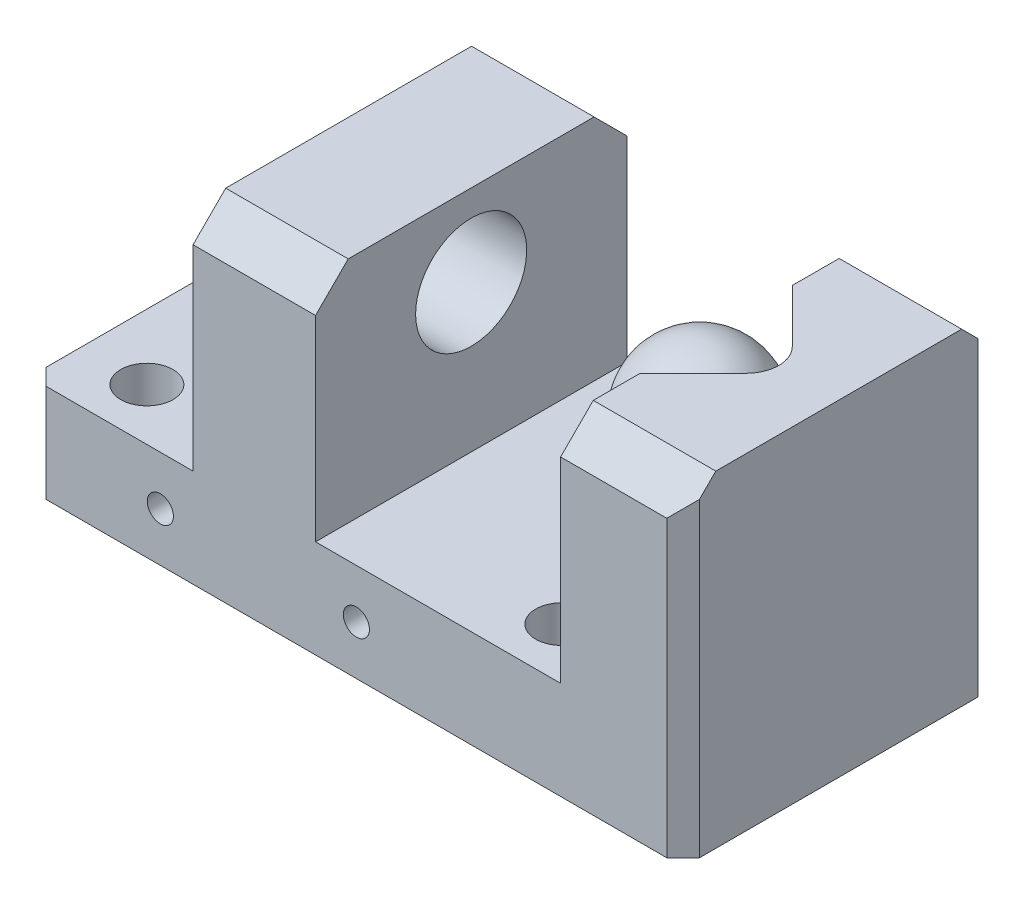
ISO-10303-21;
HEADER;
FILE_DESCRIPTION(('STEP AP214'),'2;1');
FILE_NAME('part.step','',(''),(''),'','','');
FILE_SCHEMA(('AUTOMOTIVE_DESIGN { 1 0 10303 214 1 1 1 1 }'));
ENDSEC;
DATA;
#1=APPLICATION_CONTEXT('core data for automotive mechanical design processes');
#2=APPLICATION_PROTOCOL_DEFINITION('international standard','automotive_design',2000,#1);
#3=PRODUCT_CONTEXT('',#1,'mechanical');
#4=PRODUCT('Part','Part','',(#3));
#5=PRODUCT_RELATED_PRODUCT_CATEGORY('part','',(#4));
#6=PRODUCT_DEFINITION_FORMATION('','',#4);
#7=PRODUCT_DEFINITION_CONTEXT('part definition',#1,'design');
#8=PRODUCT_DEFINITION('design','',#6,#7);
#9=PRODUCT_DEFINITION_SHAPE('','',#8);
#10=(LENGTH_UNIT() NAMED_UNIT(*) SI_UNIT(.MILLI.,.METRE.));
#11=(NAMED_UNIT(*) PLANE_ANGLE_UNIT() SI_UNIT($,.RADIAN.));
#12=(NAMED_UNIT(*) SI_UNIT($,.STERADIAN.) SOLID_ANGLE_UNIT());
#13=UNCERTAINTY_MEASURE_WITH_UNIT(LENGTH_MEASURE(1.E-05),#10,'distance_accuracy_value','');
#14=(GEOMETRIC_REPRESENTATION_CONTEXT(3) GLOBAL_UNCERTAINTY_ASSIGNED_CONTEXT((#13)) GLOBAL_UNIT_ASSIGNED_CONTEXT((#10,
#11,#12)) REPRESENTATION_CONTEXT('',''));
#15=CARTESIAN_POINT('',(0.,0.,0.));
#16=DIRECTION('',(0.,0.,1.));
#17=DIRECTION('',(1.,0.,0.));
#18=AXIS2_PLACEMENT_3D('',#15,#16,#17);
#19=CARTESIAN_POINT('',(31.5,15.,0.));
#20=DIRECTION('',(-1.,0.,0.));
#21=DIRECTION('',(0.,0.,-1.));
#22=AXIS2_PLACEMENT_3D('',#19,#20,#21);
#23=SPHERICAL_SURFACE('',#22,4.);
#24=CARTESIAN_POINT('',(27.5,15.,0.));
#25=VERTEX_POINT('',#24);
#26=VERTEX_LOOP('',#25);
#27=FACE_BOUND('',#26,.T.);
#28=ADVANCED_FACE('F40',(#27),#23,.T.);
#29=CLOSED_SHELL('',(#28));
#30=MANIFOLD_SOLID_BREP('B2',#29);
#31=CARTESIAN_POINT('',(40.,20.,9.525));
#32=DIRECTION('',(0.,-1.,0.));
#33=DIRECTION('',(0.,0.,-1.));
#34=AXIS2_PLACEMENT_3D('',#31,#32,#33);
#35=PLANE('',#34);
#36=DIRECTION('',(0.,0.,-1.));
#37=VECTOR('',#36,1.);
#38=CARTESIAN_POINT('',(32.5,20.,9.525));
#39=LINE('',#38,#37);
#40=CARTESIAN_POINT('',(32.5,20.,7.52499999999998));
#41=VERTEX_POINT('',#40);
#42=CARTESIAN_POINT('',(32.5,20.,4.65685424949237));
#43=VERTEX_POINT('',#42);
#44=EDGE_CURVE('E325',#41,#43,#39,.T.);
#45=ORIENTED_EDGE('',*,*,#44,.F.);
#46=DIRECTION('',(1.,0.,0.));
#47=VECTOR('',#46,1.);
#48=CARTESIAN_POINT('',(40.,20.,7.52499999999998));
#49=LINE('',#48,#47);
#50=CARTESIAN_POINT('',(40.,20.,7.52499999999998));
#51=VERTEX_POINT('',#50);
#52=EDGE_CURVE('E353',#41,#51,#49,.T.);
#53=ORIENTED_EDGE('',*,*,#52,.T.);
#54=DIRECTION('',(0.,0.,-1.));
#55=VECTOR('',#54,1.);
#56=CARTESIAN_POINT('',(40.,20.,9.525));
#57=LINE('',#56,#55);
#58=CARTESIAN_POINT('',(40.,20.,-7.52499999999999));
#59=VERTEX_POINT('',#58);
#60=EDGE_CURVE('E327',#51,#59,#57,.T.);
#61=ORIENTED_EDGE('',*,*,#60,.T.);
#62=DIRECTION('',(-1.,0.,0.));
#63=VECTOR('',#62,1.);
#64=CARTESIAN_POINT('',(32.5,20.,-7.525));
#65=LINE('',#64,#63);
#66=CARTESIAN_POINT('',(32.5,20.,-7.52499999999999));
#67=VERTEX_POINT('',#66);
#68=EDGE_CURVE('E350',#59,#67,#65,.T.);
#69=ORIENTED_EDGE('',*,*,#68,.T.);
#70=CARTESIAN_POINT('',(32.5,20.,-4.65685424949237));
#71=VERTEX_POINT('',#70);
#72=EDGE_CURVE('E324',#71,#67,#39,.T.);
#73=ORIENTED_EDGE('',*,*,#72,.F.);
#74=DIRECTION('',(-0.707106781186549,0.,-0.707106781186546));
#75=VECTOR('',#74,1.);
#76=CARTESIAN_POINT('',(43.3409271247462,20.,6.18407287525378));
#77=LINE('',#76,#75);
#78=CARTESIAN_POINT('',(35.7426406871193,20.,-1.4142135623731));
#79=VERTEX_POINT('',#78);
#80=EDGE_CURVE('E248',#79,#71,#77,.T.);
#81=ORIENTED_EDGE('',*,*,#80,.F.);
#82=CARTESIAN_POINT('',(34.3284271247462,20.,0.));
#83=DIRECTION('',(0.,-1.,0.));
#84=DIRECTION('',(0.,0.,-1.));
#85=AXIS2_PLACEMENT_3D('',#82,#83,#84);
#86=CIRCLE('',#85,2.);
#87=CARTESIAN_POINT('',(35.7426406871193,20.,1.4142135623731));
#88=VERTEX_POINT('',#87);
#89=EDGE_CURVE('E339',#88,#79,#86,.F.);
#90=ORIENTED_EDGE('',*,*,#89,.F.);
#91=DIRECTION('',(0.707106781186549,0.,-0.707106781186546));
#92=VECTOR('',#91,1.);
#93=CARTESIAN_POINT('',(33.8159271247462,20.,3.34092712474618));
#94=LINE('',#93,#92);
#95=EDGE_CURVE('E246',#43,#88,#94,.T.);
#96=ORIENTED_EDGE('',*,*,#95,.F.);
#97=EDGE_LOOP('',(#45,#53,#61,#69,#73,#81,#90,#96));
#98=FACE_BOUND('',#97,.T.);
#99=ADVANCED_FACE('F50',(#98),#35,.F.);
#100=CARTESIAN_POINT('',(32.5,20.,9.525));
#101=DIRECTION('',(1.,0.,0.));
#102=DIRECTION('',(0.,0.,-1.));
#103=AXIS2_PLACEMENT_3D('',#100,#101,#102);
#104=PLANE('',#103);
#105=DIRECTION('',(0.,-1.,0.));
#106=VECTOR('',#105,1.);
#107=CARTESIAN_POINT('',(32.5,20.,9.525));
#108=LINE('',#107,#106);
#109=CARTESIAN_POINT('',(32.5,18.,9.525));
#110=VERTEX_POINT('',#109);
#111=CARTESIAN_POINT('',(32.5,6.,9.525));
#112=VERTEX_POINT('',#111);
#113=EDGE_CURVE('E277',#110,#112,#108,.T.);
#114=ORIENTED_EDGE('',*,*,#113,.F.);
#115=DIRECTION('',(0.,-0.707106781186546,0.707106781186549));
#116=VECTOR('',#115,1.);
#117=CARTESIAN_POINT('',(32.5,18.,9.525));
#118=LINE('',#117,#116);
#119=EDGE_CURVE('E348',#110,#41,#118,.F.);
#120=ORIENTED_EDGE('',*,*,#119,.T.);
#121=ORIENTED_EDGE('',*,*,#44,.T.);
#122=DIRECTION('',(0.,1.,0.));
#123=VECTOR('',#122,1.);
#124=CARTESIAN_POINT('',(32.5,20.,4.65685424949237));
#125=LINE('',#124,#123);
#126=CARTESIAN_POINT('',(32.5,10.,4.65685424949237));
#127=VERTEX_POINT('',#126);
#128=EDGE_CURVE('E333',#127,#43,#125,.T.);
#129=ORIENTED_EDGE('',*,*,#128,.F.);
#130=DIRECTION('',(0.,0.,1.));
#131=VECTOR('',#130,1.);
#132=CARTESIAN_POINT('',(32.5,10.,-4.65685424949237));
#133=LINE('',#132,#131);
#134=CARTESIAN_POINT('',(32.5,10.,-4.65685424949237));
#135=VERTEX_POINT('',#134);
#136=EDGE_CURVE('E233',#135,#127,#133,.T.);
#137=ORIENTED_EDGE('',*,*,#136,.F.);
#138=DIRECTION('',(0.,-1.,0.));
#139=VECTOR('',#138,1.);
#140=CARTESIAN_POINT('',(32.5,20.,-4.65685424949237));
#141=LINE('',#140,#139);
#142=EDGE_CURVE('E336',#71,#135,#141,.T.);
#143=ORIENTED_EDGE('',*,*,#142,.F.);
#144=ORIENTED_EDGE('',*,*,#72,.T.);
#145=DIRECTION('',(0.,-0.70710678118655,-0.707106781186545));
#146=VECTOR('',#145,1.);
#147=CARTESIAN_POINT('',(32.5,20.,-7.525));
#148=LINE('',#147,#146);
#149=CARTESIAN_POINT('',(32.5,18.,-9.525));
#150=VERTEX_POINT('',#149);
#151=EDGE_CURVE('E346',#67,#150,#148,.T.);
#152=ORIENTED_EDGE('',*,*,#151,.T.);
#153=DIRECTION('',(0.,-1.,0.));
#154=VECTOR('',#153,1.);
#155=CARTESIAN_POINT('',(32.5,20.,-9.525));
#156=LINE('',#155,#154);
#157=CARTESIAN_POINT('',(32.5,6.,-9.525));
#158=VERTEX_POINT('',#157);
#159=EDGE_CURVE('E293',#150,#158,#156,.T.);
#160=ORIENTED_EDGE('',*,*,#159,.T.);
#161=DIRECTION('',(0.,0.,-1.));
#162=VECTOR('',#161,1.);
#163=CARTESIAN_POINT('',(32.5,6.,9.525));
#164=LINE('',#163,#162);
#165=EDGE_CURVE('E321',#112,#158,#164,.T.);
#166=ORIENTED_EDGE('',*,*,#165,.F.);
#167=EDGE_LOOP('',(#114,#120,#121,#129,#137,#143,#144,#152,#160,#166));
#168=FACE_BOUND('',#167,.T.);
#169=ADVANCED_FACE('F419',(#168),#104,.F.);
#170=CARTESIAN_POINT('',(0.,0.,9.525));
#171=DIRECTION('',(0.,1.,0.));
#172=DIRECTION('',(-1.,0.,0.));
#173=AXIS2_PLACEMENT_3D('',#170,#171,#172);
#174=PLANE('',#173);
#175=CARTESIAN_POINT('',(4.,0.,-6.35));
#176=DIRECTION('',(0.,-1.,0.));
#177=DIRECTION('',(0.,0.,-1.));
#178=AXIS2_PLACEMENT_3D('',#175,#176,#177);
#179=CIRCLE('',#178,1.59999999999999);
#180=CARTESIAN_POINT('',(4.,0.,-7.94999999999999));
#181=VERTEX_POINT('',#180);
#182=EDGE_CURVE('E250',#181,#181,#179,.T.);
#183=ORIENTED_EDGE('',*,*,#182,.F.);
#184=EDGE_LOOP('',(#183));
#185=FACE_BOUND('',#184,.T.);
#186=CARTESIAN_POINT('',(29.4,0.,-6.35));
#187=DIRECTION('',(0.,-1.,0.));
#188=DIRECTION('',(0.,0.,-1.));
#189=AXIS2_PLACEMENT_3D('',#186,#187,#188);
#190=CIRCLE('',#189,1.59999999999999);
#191=CARTESIAN_POINT('',(29.4,0.,-7.94999999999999));
#192=VERTEX_POINT('',#191);
#193=EDGE_CURVE('E256',#192,#192,#190,.T.);
#194=ORIENTED_EDGE('',*,*,#193,.F.);
#195=EDGE_LOOP('',(#194));
#196=FACE_BOUND('',#195,.T.);
#197=CARTESIAN_POINT('',(4.,0.,6.35));
#198=DIRECTION('',(0.,-1.,0.));
#199=DIRECTION('',(0.,0.,-1.));
#200=AXIS2_PLACEMENT_3D('',#197,#198,#199);
#201=CIRCLE('',#200,1.59999999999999);
#202=CARTESIAN_POINT('',(4.,0.,4.75000000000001));
#203=VERTEX_POINT('',#202);
#204=EDGE_CURVE('E262',#203,#203,#201,.T.);
#205=ORIENTED_EDGE('',*,*,#204,.F.);
#206=EDGE_LOOP('',(#205));
#207=FACE_BOUND('',#206,.T.);
#208=CARTESIAN_POINT('',(29.4,0.,6.35000000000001));
#209=DIRECTION('',(0.,-1.,0.));
#210=DIRECTION('',(0.,0.,-1.));
#211=AXIS2_PLACEMENT_3D('',#208,#209,#210);
#212=CIRCLE('',#211,1.59999999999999);
#213=CARTESIAN_POINT('',(29.4,0.,4.75000000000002));
#214=VERTEX_POINT('',#213);
#215=EDGE_CURVE('E268',#214,#214,#212,.T.);
#216=ORIENTED_EDGE('',*,*,#215,.F.);
#217=EDGE_LOOP('',(#216));
#218=FACE_BOUND('',#217,.T.);
#219=DIRECTION('',(1.,0.,0.));
#220=VECTOR('',#219,1.);
#221=CARTESIAN_POINT('',(0.,0.,-9.525));
#222=LINE('',#221,#220);
#223=CARTESIAN_POINT('',(1.,0.,-9.525));
#224=VERTEX_POINT('',#223);
#225=CARTESIAN_POINT('',(39.,0.,-9.525));
#226=VERTEX_POINT('',#225);
#227=EDGE_CURVE('E274',#224,#226,#222,.T.);
#228=ORIENTED_EDGE('',*,*,#227,.T.);
#229=DIRECTION('',(0.707106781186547,0.,0.707106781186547));
#230=VECTOR('',#229,1.);
#231=CARTESIAN_POINT('',(40.,0.,-8.525));
#232=LINE('',#231,#230);
#233=CARTESIAN_POINT('',(40.,0.,-8.52500000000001));
#234=VERTEX_POINT('',#233);
#235=EDGE_CURVE('E406',#226,#234,#232,.T.);
#236=ORIENTED_EDGE('',*,*,#235,.T.);
#237=DIRECTION('',(0.,0.,-1.));
#238=VECTOR('',#237,1.);
#239=CARTESIAN_POINT('',(40.,0.,9.525));
#240=LINE('',#239,#238);
#241=CARTESIAN_POINT('',(40.,0.,8.52499999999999));
#242=VERTEX_POINT('',#241);
#243=EDGE_CURVE('E330',#242,#234,#240,.T.);
#244=ORIENTED_EDGE('',*,*,#243,.F.);
#245=DIRECTION('',(0.70710678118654,0.,-0.707106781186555));
#246=VECTOR('',#245,1.);
#247=CARTESIAN_POINT('',(39.,0.,9.525));
#248=LINE('',#247,#246);
#249=CARTESIAN_POINT('',(39.,0.,9.525));
#250=VERTEX_POINT('',#249);
#251=EDGE_CURVE('E71',#242,#250,#248,.F.);
#252=ORIENTED_EDGE('',*,*,#251,.T.);
#253=DIRECTION('',(1.,0.,0.));
#254=VECTOR('',#253,1.);
#255=CARTESIAN_POINT('',(0.,0.,9.525));
#256=LINE('',#255,#254);
#257=CARTESIAN_POINT('',(1.,0.,9.525));
#258=VERTEX_POINT('',#257);
#259=EDGE_CURVE('E275',#258,#250,#256,.T.);
#260=ORIENTED_EDGE('',*,*,#259,.F.);
#261=DIRECTION('',(0.707106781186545,0.,0.70710678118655));
#262=VECTOR('',#261,1.);
#263=CARTESIAN_POINT('',(1.,0.,9.525));
#264=LINE('',#263,#262);
#265=CARTESIAN_POINT('',(0.,0.,8.52499999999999));
#266=VERTEX_POINT('',#265);
#267=EDGE_CURVE('E383',#258,#266,#264,.F.);
#268=ORIENTED_EDGE('',*,*,#267,.T.);
#269=DIRECTION('',(0.,0.,-1.));
#270=VECTOR('',#269,1.);
#271=CARTESIAN_POINT('',(0.,0.,9.525));
#272=LINE('',#271,#270);
#273=CARTESIAN_POINT('',(0.,0.,-8.525));
#274=VERTEX_POINT('',#273);
#275=EDGE_CURVE('E290',#266,#274,#272,.T.);
#276=ORIENTED_EDGE('',*,*,#275,.T.);
#277=DIRECTION('',(0.70710678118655,0.,-0.707106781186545));
#278=VECTOR('',#277,1.);
#279=CARTESIAN_POINT('',(0.,0.,-8.525));
#280=LINE('',#279,#278);
#281=EDGE_CURVE('E381',#274,#224,#280,.T.);
#282=ORIENTED_EDGE('',*,*,#281,.T.);
#283=EDGE_LOOP('',(#228,#236,#244,#252,#260,#268,#276,#282));
#284=FACE_BOUND('',#283,.T.);
#285=ADVANCED_FACE('F452',(#185,#196,#207,#218,#284),#174,.F.);
#286=CARTESIAN_POINT('',(40.,20.,9.525));
#287=DIRECTION('',(-1.,0.,0.));
#288=DIRECTION('',(0.,-1.,0.));
#289=AXIS2_PLACEMENT_3D('',#286,#287,#288);
#290=PLANE('',#289);
#291=ORIENTED_EDGE('',*,*,#243,.T.);
#292=DIRECTION('',(0.,1.,0.));
#293=VECTOR('',#292,1.);
#294=CARTESIAN_POINT('',(40.,18.,-8.525));
#295=LINE('',#294,#293);
#296=CARTESIAN_POINT('',(40.,19.,-8.525));
#297=VERTEX_POINT('',#296);
#298=EDGE_CURVE('E398',#234,#297,#295,.T.);
#299=ORIENTED_EDGE('',*,*,#298,.T.);
#300=DIRECTION('',(0.,0.70710678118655,0.707106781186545));
#301=VECTOR('',#300,1.);
#302=CARTESIAN_POINT('',(40.,20.,-7.525));
#303=LINE('',#302,#301);
#304=EDGE_CURVE('E355',#297,#59,#303,.T.);
#305=ORIENTED_EDGE('',*,*,#304,.T.);
#306=ORIENTED_EDGE('',*,*,#60,.F.);
#307=DIRECTION('',(0.,0.707106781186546,-0.707106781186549));
#308=VECTOR('',#307,1.);
#309=CARTESIAN_POINT('',(40.,18.,9.52499999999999));
#310=LINE('',#309,#308);
#311=CARTESIAN_POINT('',(40.,19.,8.52499999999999));
#312=VERTEX_POINT('',#311);
#313=EDGE_CURVE('E357',#51,#312,#310,.F.);
#314=ORIENTED_EDGE('',*,*,#313,.T.);
#315=DIRECTION('',(0.,-1.,0.));
#316=VECTOR('',#315,1.);
#317=CARTESIAN_POINT('',(40.,20.,8.52499999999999));
#318=LINE('',#317,#316);
#319=EDGE_CURVE('E396',#312,#242,#318,.T.);
#320=ORIENTED_EDGE('',*,*,#319,.T.);
#321=EDGE_LOOP('',(#291,#299,#305,#306,#314,#320));
#322=FACE_BOUND('',#321,.T.);
#323=ADVANCED_FACE('F471',(#322),#290,.F.);
#324=CARTESIAN_POINT('',(32.5,6.,9.525));
#325=DIRECTION('',(0.,-1.,0.));
#326=DIRECTION('',(1.,0.,0.));
#327=AXIS2_PLACEMENT_3D('',#324,#325,#326);
#328=PLANE('',#327);
#329=CARTESIAN_POINT('',(29.4,6.,-6.35));
#330=DIRECTION('',(0.,-1.,0.));
#331=DIRECTION('',(1.,0.,0.));
#332=AXIS2_PLACEMENT_3D('',#329,#330,#331);
#333=CIRCLE('',#332,1.59999999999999);
#334=CARTESIAN_POINT('',(31.,6.,-6.35));
#335=VERTEX_POINT('',#334);
#336=EDGE_CURVE('E259',#335,#335,#333,.T.);
#337=ORIENTED_EDGE('',*,*,#336,.T.);
#338=EDGE_LOOP('',(#337));
#339=FACE_BOUND('',#338,.T.);
#340=CARTESIAN_POINT('',(29.4,6.,6.35000000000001));
#341=DIRECTION('',(0.,-1.,0.));
#342=DIRECTION('',(1.,0.,0.));
#343=AXIS2_PLACEMENT_3D('',#340,#341,#342);
#344=CIRCLE('',#343,1.59999999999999);
#345=CARTESIAN_POINT('',(31.,6.,6.35000000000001));
#346=VERTEX_POINT('',#345);
#347=EDGE_CURVE('E271',#346,#346,#344,.T.);
#348=ORIENTED_EDGE('',*,*,#347,.T.);
#349=EDGE_LOOP('',(#348));
#350=FACE_BOUND('',#349,.T.);
#351=DIRECTION('',(-1.,0.,0.));
#352=VECTOR('',#351,1.);
#353=CARTESIAN_POINT('',(32.5,6.,-9.525));
#354=LINE('',#353,#352);
#355=CARTESIAN_POINT('',(17.5,6.,-9.525));
#356=VERTEX_POINT('',#355);
#357=EDGE_CURVE('E295',#158,#356,#354,.T.);
#358=ORIENTED_EDGE('',*,*,#357,.T.);
#359=DIRECTION('',(0.,0.,-1.));
#360=VECTOR('',#359,1.);
#361=CARTESIAN_POINT('',(17.5,6.,9.525));
#362=LINE('',#361,#360);
#363=CARTESIAN_POINT('',(17.5,6.,9.525));
#364=VERTEX_POINT('',#363);
#365=EDGE_CURVE('E318',#364,#356,#362,.T.);
#366=ORIENTED_EDGE('',*,*,#365,.F.);
#367=DIRECTION('',(-1.,0.,0.));
#368=VECTOR('',#367,1.);
#369=CARTESIAN_POINT('',(32.5,6.,9.525));
#370=LINE('',#369,#368);
#371=EDGE_CURVE('E280',#112,#364,#370,.T.);
#372=ORIENTED_EDGE('',*,*,#371,.F.);
#373=ORIENTED_EDGE('',*,*,#165,.T.);
#374=EDGE_LOOP('',(#358,#366,#372,#373));
#375=FACE_BOUND('',#374,.T.);
#376=ADVANCED_FACE('F425',(#339,#350,#375),#328,.F.);
#377=CARTESIAN_POINT('',(17.5,6.,9.525));
#378=DIRECTION('',(-1.,0.,0.));
#379=DIRECTION('',(0.,0.,1.));
#380=AXIS2_PLACEMENT_3D('',#377,#378,#379);
#381=PLANE('',#380);
#382=CARTESIAN_POINT('',(17.5,15.,0.));
#383=DIRECTION('',(-1.,0.,0.));
#384=DIRECTION('',(0.,0.,1.));
#385=AXIS2_PLACEMENT_3D('',#382,#383,#384);
#386=CIRCLE('',#385,3.4);
#387=CARTESIAN_POINT('',(17.5,15.,3.4));
#388=VERTEX_POINT('',#387);
#389=EDGE_CURVE('E228',#388,#388,#386,.T.);
#390=ORIENTED_EDGE('',*,*,#389,.T.);
#391=EDGE_LOOP('',(#390));
#392=FACE_BOUND('',#391,.T.);
#393=DIRECTION('',(0.,0.,-1.));
#394=VECTOR('',#393,1.);
#395=CARTESIAN_POINT('',(17.5,20.,9.525));
#396=LINE('',#395,#394);
#397=CARTESIAN_POINT('',(17.5,20.,7.52499999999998));
#398=VERTEX_POINT('',#397);
#399=CARTESIAN_POINT('',(17.5,20.,-7.525));
#400=VERTEX_POINT('',#399);
#401=EDGE_CURVE('E315',#398,#400,#396,.T.);
#402=ORIENTED_EDGE('',*,*,#401,.F.);
#403=DIRECTION('',(0.,0.707106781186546,-0.707106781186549));
#404=VECTOR('',#403,1.);
#405=CARTESIAN_POINT('',(17.5,18.,9.525));
#406=LINE('',#405,#404);
#407=CARTESIAN_POINT('',(17.5,18.,9.525));
#408=VERTEX_POINT('',#407);
#409=EDGE_CURVE('E376',#398,#408,#406,.F.);
#410=ORIENTED_EDGE('',*,*,#409,.T.);
#411=DIRECTION('',(0.,1.,0.));
#412=VECTOR('',#411,1.);
#413=CARTESIAN_POINT('',(17.5,6.,9.525));
#414=LINE('',#413,#412);
#415=EDGE_CURVE('E282',#364,#408,#414,.T.);
#416=ORIENTED_EDGE('',*,*,#415,.F.);
#417=ORIENTED_EDGE('',*,*,#365,.T.);
#418=DIRECTION('',(0.,1.,0.));
#419=VECTOR('',#418,1.);
#420=CARTESIAN_POINT('',(17.5,6.,-9.525));
#421=LINE('',#420,#419);
#422=CARTESIAN_POINT('',(17.5,18.,-9.525));
#423=VERTEX_POINT('',#422);
#424=EDGE_CURVE('E297',#356,#423,#421,.T.);
#425=ORIENTED_EDGE('',*,*,#424,.T.);
#426=DIRECTION('',(0.,0.70710678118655,0.707106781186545));
#427=VECTOR('',#426,1.);
#428=CARTESIAN_POINT('',(17.5,20.,-7.525));
#429=LINE('',#428,#427);
#430=EDGE_CURVE('E374',#423,#400,#429,.T.);
#431=ORIENTED_EDGE('',*,*,#430,.T.);
#432=EDGE_LOOP('',(#402,#410,#416,#417,#425,#431));
#433=FACE_BOUND('',#432,.T.);
#434=ADVANCED_FACE('F430',(#392,#433),#381,.F.);
#435=CARTESIAN_POINT('',(17.5,20.,9.525));
#436=DIRECTION('',(0.,-1.,0.));
#437=DIRECTION('',(1.,0.,0.));
#438=AXIS2_PLACEMENT_3D('',#435,#436,#437);
#439=PLANE('',#438);
#440=DIRECTION('',(0.,0.,-1.));
#441=VECTOR('',#440,1.);
#442=CARTESIAN_POINT('',(10.,20.,9.525));
#443=LINE('',#442,#441);
#444=CARTESIAN_POINT('',(10.,20.,7.52499999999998));
#445=VERTEX_POINT('',#444);
#446=CARTESIAN_POINT('',(10.,20.,-7.525));
#447=VERTEX_POINT('',#446);
#448=EDGE_CURVE('E312',#445,#447,#443,.T.);
#449=ORIENTED_EDGE('',*,*,#448,.F.);
#450=DIRECTION('',(1.,0.,0.));
#451=VECTOR('',#450,1.);
#452=CARTESIAN_POINT('',(17.5,20.,7.52499999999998));
#453=LINE('',#452,#451);
#454=EDGE_CURVE('E372',#445,#398,#453,.T.);
#455=ORIENTED_EDGE('',*,*,#454,.T.);
#456=ORIENTED_EDGE('',*,*,#401,.T.);
#457=DIRECTION('',(-1.,0.,0.));
#458=VECTOR('',#457,1.);
#459=CARTESIAN_POINT('',(10.,20.,-7.525));
#460=LINE('',#459,#458);
#461=EDGE_CURVE('E369',#400,#447,#460,.T.);
#462=ORIENTED_EDGE('',*,*,#461,.T.);
#463=EDGE_LOOP('',(#449,#455,#456,#462));
#464=FACE_BOUND('',#463,.T.);
#465=ADVANCED_FACE('F670',(#464),#439,.F.);
#466=CARTESIAN_POINT('',(10.,20.,9.525));
#467=DIRECTION('',(1.,0.,0.));
#468=DIRECTION('',(0.,1.,0.));
#469=AXIS2_PLACEMENT_3D('',#466,#467,#468);
#470=PLANE('',#469);
#471=CARTESIAN_POINT('',(10.,15.,0.));
#472=DIRECTION('',(-1.,0.,0.));
#473=DIRECTION('',(0.,0.,1.));
#474=AXIS2_PLACEMENT_3D('',#471,#472,#473);
#475=CIRCLE('',#474,3.4);
#476=CARTESIAN_POINT('',(10.,15.,3.4));
#477=VERTEX_POINT('',#476);
#478=EDGE_CURVE('E225',#477,#477,#475,.T.);
#479=ORIENTED_EDGE('',*,*,#478,.F.);
#480=EDGE_LOOP('',(#479));
#481=FACE_BOUND('',#480,.T.);
#482=DIRECTION('',(0.,-1.,0.));
#483=VECTOR('',#482,1.);
#484=CARTESIAN_POINT('',(10.,20.,9.525));
#485=LINE('',#484,#483);
#486=CARTESIAN_POINT('',(10.,18.,9.525));
#487=VERTEX_POINT('',#486);
#488=CARTESIAN_POINT('',(10.,6.,9.525));
#489=VERTEX_POINT('',#488);
#490=EDGE_CURVE('E285',#487,#489,#485,.T.);
#491=ORIENTED_EDGE('',*,*,#490,.F.);
#492=DIRECTION('',(0.,-0.707106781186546,0.707106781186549));
#493=VECTOR('',#492,1.);
#494=CARTESIAN_POINT('',(10.,18.,9.525));
#495=LINE('',#494,#493);
#496=EDGE_CURVE('E367',#487,#445,#495,.F.);
#497=ORIENTED_EDGE('',*,*,#496,.T.);
#498=ORIENTED_EDGE('',*,*,#448,.T.);
#499=DIRECTION('',(0.,-0.70710678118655,-0.707106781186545));
#500=VECTOR('',#499,1.);
#501=CARTESIAN_POINT('',(10.,20.,-7.525));
#502=LINE('',#501,#500);
#503=CARTESIAN_POINT('',(10.,18.,-9.525));
#504=VERTEX_POINT('',#503);
#505=EDGE_CURVE('E365',#447,#504,#502,.T.);
#506=ORIENTED_EDGE('',*,*,#505,.T.);
#507=DIRECTION('',(0.,-1.,0.));
#508=VECTOR('',#507,1.);
#509=CARTESIAN_POINT('',(10.,20.,-9.525));
#510=LINE('',#509,#508);
#511=CARTESIAN_POINT('',(10.,6.,-9.525));
#512=VERTEX_POINT('',#511);
#513=EDGE_CURVE('E300',#504,#512,#510,.T.);
#514=ORIENTED_EDGE('',*,*,#513,.T.);
#515=DIRECTION('',(0.,0.,-1.));
#516=VECTOR('',#515,1.);
#517=CARTESIAN_POINT('',(10.,6.,9.525));
#518=LINE('',#517,#516);
#519=EDGE_CURVE('E309',#489,#512,#518,.T.);
#520=ORIENTED_EDGE('',*,*,#519,.F.);
#521=EDGE_LOOP('',(#491,#497,#498,#506,#514,#520));
#522=FACE_BOUND('',#521,.T.);
#523=ADVANCED_FACE('F438',(#481,#522),#470,.F.);
#524=CARTESIAN_POINT('',(10.,6.,9.525));
#525=DIRECTION('',(0.,-1.,0.));
#526=DIRECTION('',(1.,0.,0.));
#527=AXIS2_PLACEMENT_3D('',#524,#525,#526);
#528=PLANE('',#527);
#529=CARTESIAN_POINT('',(4.,6.,-6.35));
#530=DIRECTION('',(0.,-1.,0.));
#531=DIRECTION('',(1.,0.,0.));
#532=AXIS2_PLACEMENT_3D('',#529,#530,#531);
#533=CIRCLE('',#532,1.59999999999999);
#534=CARTESIAN_POINT('',(5.6,6.,-6.35));
#535=VERTEX_POINT('',#534);
#536=EDGE_CURVE('E253',#535,#535,#533,.T.);
#537=ORIENTED_EDGE('',*,*,#536,.T.);
#538=EDGE_LOOP('',(#537));
#539=FACE_BOUND('',#538,.T.);
#540=CARTESIAN_POINT('',(4.,6.,6.35));
#541=DIRECTION('',(0.,-1.,0.));
#542=DIRECTION('',(1.,0.,0.));
#543=AXIS2_PLACEMENT_3D('',#540,#541,#542);
#544=CIRCLE('',#543,1.59999999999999);
#545=CARTESIAN_POINT('',(5.6,6.,6.35));
#546=VERTEX_POINT('',#545);
#547=EDGE_CURVE('E265',#546,#546,#544,.T.);
#548=ORIENTED_EDGE('',*,*,#547,.T.);
#549=EDGE_LOOP('',(#548));
#550=FACE_BOUND('',#549,.T.);
#551=DIRECTION('',(0.,0.,-1.));
#552=VECTOR('',#551,1.);
#553=CARTESIAN_POINT('',(0.,5.99999999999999,9.525));
#554=LINE('',#553,#552);
#555=CARTESIAN_POINT('',(0.,5.99999999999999,8.52499999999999));
#556=VERTEX_POINT('',#555);
#557=CARTESIAN_POINT('',(0.,5.99999999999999,-8.525));
#558=VERTEX_POINT('',#557);
#559=EDGE_CURVE('E306',#556,#558,#554,.T.);
#560=ORIENTED_EDGE('',*,*,#559,.F.);
#561=DIRECTION('',(-0.707106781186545,0.,-0.70710678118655));
#562=VECTOR('',#561,1.);
#563=CARTESIAN_POINT('',(1.,5.99999999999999,9.525));
#564=LINE('',#563,#562);
#565=CARTESIAN_POINT('',(1.,5.99999999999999,9.525));
#566=VERTEX_POINT('',#565);
#567=EDGE_CURVE('E392',#556,#566,#564,.F.);
#568=ORIENTED_EDGE('',*,*,#567,.T.);
#569=DIRECTION('',(-1.,0.,0.));
#570=VECTOR('',#569,1.);
#571=CARTESIAN_POINT('',(10.,6.,9.525));
#572=LINE('',#571,#570);
#573=EDGE_CURVE('E287',#489,#566,#572,.T.);
#574=ORIENTED_EDGE('',*,*,#573,.F.);
#575=ORIENTED_EDGE('',*,*,#519,.T.);
#576=DIRECTION('',(-1.,0.,0.));
#577=VECTOR('',#576,1.);
#578=CARTESIAN_POINT('',(10.,6.,-9.525));
#579=LINE('',#578,#577);
#580=CARTESIAN_POINT('',(1.,5.99999999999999,-9.525));
#581=VERTEX_POINT('',#580);
#582=EDGE_CURVE('E278',#512,#581,#579,.T.);
#583=ORIENTED_EDGE('',*,*,#582,.T.);
#584=DIRECTION('',(-0.70710678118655,0.,0.707106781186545));
#585=VECTOR('',#584,1.);
#586=CARTESIAN_POINT('',(0.,5.99999999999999,-8.525));
#587=LINE('',#586,#585);
#588=EDGE_CURVE('E390',#581,#558,#587,.T.);
#589=ORIENTED_EDGE('',*,*,#588,.T.);
#590=EDGE_LOOP('',(#560,#568,#574,#575,#583,#589));
#591=FACE_BOUND('',#590,.T.);
#592=ADVANCED_FACE('F445',(#539,#550,#591),#528,.F.);
#593=CARTESIAN_POINT('',(0.,5.99999999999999,9.525));
#594=DIRECTION('',(1.,0.,0.));
#595=DIRECTION('',(0.,1.,0.));
#596=AXIS2_PLACEMENT_3D('',#593,#594,#595);
#597=PLANE('',#596);
#598=ORIENTED_EDGE('',*,*,#275,.F.);
#599=DIRECTION('',(0.,1.,0.));
#600=VECTOR('',#599,1.);
#601=CARTESIAN_POINT('',(0.,5.99999999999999,8.52499999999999));
#602=LINE('',#601,#600);
#603=EDGE_CURVE('E388',#266,#556,#602,.T.);
#604=ORIENTED_EDGE('',*,*,#603,.T.);
#605=ORIENTED_EDGE('',*,*,#559,.T.);
#606=DIRECTION('',(0.,-1.,0.));
#607=VECTOR('',#606,1.);
#608=CARTESIAN_POINT('',(0.,0.,-8.525));
#609=LINE('',#608,#607);
#610=EDGE_CURVE('E385',#558,#274,#609,.T.);
#611=ORIENTED_EDGE('',*,*,#610,.T.);
#612=EDGE_LOOP('',(#598,#604,#605,#611));
#613=FACE_BOUND('',#612,.T.);
#614=ADVANCED_FACE('F454',(#613),#597,.F.);
#615=CARTESIAN_POINT('',(0.,0.,9.525));
#616=DIRECTION('',(0.,0.,-1.));
#617=DIRECTION('',(-1.,0.,0.));
#618=AXIS2_PLACEMENT_3D('',#615,#616,#617);
#619=PLANE('',#618);
#620=CARTESIAN_POINT('',(8.00000000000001,3.,9.525));
#621=DIRECTION('',(0.,0.,1.));
#622=DIRECTION('',(1.,0.,0.));
#623=AXIS2_PLACEMENT_3D('',#620,#621,#622);
#624=CIRCLE('',#623,0.799999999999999);
#625=CARTESIAN_POINT('',(8.80000000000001,3.,9.525));
#626=VERTEX_POINT('',#625);
#627=EDGE_CURVE('E215',#626,#626,#624,.T.);
#628=ORIENTED_EDGE('',*,*,#627,.F.);
#629=EDGE_LOOP('',(#628));
#630=FACE_BOUND('',#629,.T.);
#631=CARTESIAN_POINT('',(20.,3.,9.525));
#632=DIRECTION('',(0.,0.,1.));
#633=DIRECTION('',(1.,0.,0.));
#634=AXIS2_PLACEMENT_3D('',#631,#632,#633);
#635=CIRCLE('',#634,0.799999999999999);
#636=CARTESIAN_POINT('',(20.8,3.,9.525));
#637=VERTEX_POINT('',#636);
#638=EDGE_CURVE('E214',#637,#637,#635,.T.);
#639=ORIENTED_EDGE('',*,*,#638,.F.);
#640=EDGE_LOOP('',(#639));
#641=FACE_BOUND('',#640,.T.);
#642=ORIENTED_EDGE('',*,*,#259,.T.);
#643=DIRECTION('',(0.,1.,0.));
#644=VECTOR('',#643,1.);
#645=CARTESIAN_POINT('',(39.,0.,9.525));
#646=LINE('',#645,#644);
#647=CARTESIAN_POINT('',(39.,18.,9.525));
#648=VERTEX_POINT('',#647);
#649=EDGE_CURVE('E58',#250,#648,#646,.T.);
#650=ORIENTED_EDGE('',*,*,#649,.T.);
#651=DIRECTION('',(-1.,0.,0.));
#652=VECTOR('',#651,1.);
#653=CARTESIAN_POINT('',(0.,18.,9.525));
#654=LINE('',#653,#652);
#655=EDGE_CURVE('E344',#648,#110,#654,.T.);
#656=ORIENTED_EDGE('',*,*,#655,.T.);
#657=ORIENTED_EDGE('',*,*,#113,.T.);
#658=ORIENTED_EDGE('',*,*,#371,.T.);
#659=ORIENTED_EDGE('',*,*,#415,.T.);
#660=DIRECTION('',(-1.,0.,0.));
#661=VECTOR('',#660,1.);
#662=CARTESIAN_POINT('',(0.,18.,9.525));
#663=LINE('',#662,#661);
#664=EDGE_CURVE('E341',#408,#487,#663,.T.);
#665=ORIENTED_EDGE('',*,*,#664,.T.);
#666=ORIENTED_EDGE('',*,*,#490,.T.);
#667=ORIENTED_EDGE('',*,*,#573,.T.);
#668=DIRECTION('',(0.,-1.,0.));
#669=VECTOR('',#668,1.);
#670=CARTESIAN_POINT('',(1.,0.,9.525));
#671=LINE('',#670,#669);
#672=EDGE_CURVE('E378',#566,#258,#671,.T.);
#673=ORIENTED_EDGE('',*,*,#672,.T.);
#674=EDGE_LOOP('',(#642,#650,#656,#657,#658,#659,#665,#666,#667,#673));
#675=FACE_BOUND('',#674,.T.);
#676=ADVANCED_FACE('F409',(#630,#641,#675),#619,.F.);
#677=CARTESIAN_POINT('',(0.,0.,-9.525));
#678=DIRECTION('',(0.,0.,-1.));
#679=DIRECTION('',(-1.,0.,0.));
#680=AXIS2_PLACEMENT_3D('',#677,#678,#679);
#681=PLANE('',#680);
#682=DIRECTION('',(1.,0.,0.));
#683=VECTOR('',#682,1.);
#684=CARTESIAN_POINT('',(40.,18.,-9.525));
#685=LINE('',#684,#683);
#686=CARTESIAN_POINT('',(39.,18.,-9.525));
#687=VERTEX_POINT('',#686);
#688=EDGE_CURVE('E362',#150,#687,#685,.T.);
#689=ORIENTED_EDGE('',*,*,#688,.T.);
#690=DIRECTION('',(0.,-1.,0.));
#691=VECTOR('',#690,1.);
#692=CARTESIAN_POINT('',(39.,0.,-9.525));
#693=LINE('',#692,#691);
#694=EDGE_CURVE('E403',#687,#226,#693,.T.);
#695=ORIENTED_EDGE('',*,*,#694,.T.);
#696=ORIENTED_EDGE('',*,*,#227,.F.);
#697=DIRECTION('',(0.,1.,0.));
#698=VECTOR('',#697,1.);
#699=CARTESIAN_POINT('',(1.,6.,-9.525));
#700=LINE('',#699,#698);
#701=EDGE_CURVE('E394',#224,#581,#700,.T.);
#702=ORIENTED_EDGE('',*,*,#701,.T.);
#703=ORIENTED_EDGE('',*,*,#582,.F.);
#704=ORIENTED_EDGE('',*,*,#513,.F.);
#705=DIRECTION('',(1.,0.,0.));
#706=VECTOR('',#705,1.);
#707=CARTESIAN_POINT('',(17.5,18.,-9.525));
#708=LINE('',#707,#706);
#709=EDGE_CURVE('E360',#504,#423,#708,.T.);
#710=ORIENTED_EDGE('',*,*,#709,.T.);
#711=ORIENTED_EDGE('',*,*,#424,.F.);
#712=ORIENTED_EDGE('',*,*,#357,.F.);
#713=ORIENTED_EDGE('',*,*,#159,.F.);
#714=EDGE_LOOP('',(#689,#695,#696,#702,#703,#704,#710,#711,#712,#713));
#715=FACE_BOUND('',#714,.T.);
#716=ADVANCED_FACE('F463',(#715),#681,.T.);
#717=CARTESIAN_POINT('',(29.4,0.,6.35000000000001));
#718=DIRECTION('',(0.,-1.,0.));
#719=DIRECTION('',(0.,0.,-1.));
#720=AXIS2_PLACEMENT_3D('',#717,#718,#719);
#721=CYLINDRICAL_SURFACE('',#720,1.59999999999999);
#722=ORIENTED_EDGE('',*,*,#215,.T.);
#723=EDGE_LOOP('',(#722));
#724=FACE_BOUND('',#723,.T.);
#725=ORIENTED_EDGE('',*,*,#347,.F.);
#726=EDGE_LOOP('',(#725));
#727=FACE_BOUND('',#726,.T.);
#728=ADVANCED_FACE('F629',(#724,#727),#721,.F.);
#729=CARTESIAN_POINT('',(4.,0.,6.35));
#730=DIRECTION('',(0.,-1.,0.));
#731=DIRECTION('',(0.,0.,-1.));
#732=AXIS2_PLACEMENT_3D('',#729,#730,#731);
#733=CYLINDRICAL_SURFACE('',#732,1.59999999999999);
#734=ORIENTED_EDGE('',*,*,#204,.T.);
#735=EDGE_LOOP('',(#734));
#736=FACE_BOUND('',#735,.T.);
#737=ORIENTED_EDGE('',*,*,#547,.F.);
#738=EDGE_LOOP('',(#737));
#739=FACE_BOUND('',#738,.T.);
#740=ADVANCED_FACE('F621',(#736,#739),#733,.F.);
#741=CARTESIAN_POINT('',(29.4,0.,-6.35));
#742=DIRECTION('',(0.,-1.,0.));
#743=DIRECTION('',(0.,0.,-1.));
#744=AXIS2_PLACEMENT_3D('',#741,#742,#743);
#745=CYLINDRICAL_SURFACE('',#744,1.59999999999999);
#746=ORIENTED_EDGE('',*,*,#193,.T.);
#747=EDGE_LOOP('',(#746));
#748=FACE_BOUND('',#747,.T.);
#749=ORIENTED_EDGE('',*,*,#336,.F.);
#750=EDGE_LOOP('',(#749));
#751=FACE_BOUND('',#750,.T.);
#752=ADVANCED_FACE('F612',(#748,#751),#745,.F.);
#753=CARTESIAN_POINT('',(4.,0.,-6.35));
#754=DIRECTION('',(0.,-1.,0.));
#755=DIRECTION('',(0.,0.,-1.));
#756=AXIS2_PLACEMENT_3D('',#753,#754,#755);
#757=CYLINDRICAL_SURFACE('',#756,1.59999999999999);
#758=ORIENTED_EDGE('',*,*,#182,.T.);
#759=EDGE_LOOP('',(#758));
#760=FACE_BOUND('',#759,.T.);
#761=ORIENTED_EDGE('',*,*,#536,.F.);
#762=EDGE_LOOP('',(#761));
#763=FACE_BOUND('',#762,.T.);
#764=ADVANCED_FACE('F604',(#760,#763),#757,.F.);
#765=CARTESIAN_POINT('',(34.3284271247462,25.,0.));
#766=DIRECTION('',(0.,-1.,0.));
#767=DIRECTION('',(0.,0.,-1.));
#768=AXIS2_PLACEMENT_3D('',#765,#766,#767);
#769=CYLINDRICAL_SURFACE('',#768,2.);
#770=ORIENTED_EDGE('',*,*,#89,.T.);
#771=DIRECTION('',(0.,-1.,0.));
#772=VECTOR('',#771,1.);
#773=CARTESIAN_POINT('',(35.7426406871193,25.,-1.4142135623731));
#774=LINE('',#773,#772);
#775=CARTESIAN_POINT('',(35.7426406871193,10.,-1.4142135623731));
#776=VERTEX_POINT('',#775);
#777=EDGE_CURVE('E242',#79,#776,#774,.T.);
#778=ORIENTED_EDGE('',*,*,#777,.T.);
#779=CARTESIAN_POINT('',(34.3284271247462,10.,0.));
#780=DIRECTION('',(0.,1.,0.));
#781=DIRECTION('',(0.,0.,1.));
#782=AXIS2_PLACEMENT_3D('',#779,#780,#781);
#783=CIRCLE('',#782,2.);
#784=CARTESIAN_POINT('',(35.7426406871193,10.,1.4142135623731));
#785=VERTEX_POINT('',#784);
#786=EDGE_CURVE('E239',#785,#776,#783,.T.);
#787=ORIENTED_EDGE('',*,*,#786,.F.);
#788=DIRECTION('',(0.,-1.,0.));
#789=VECTOR('',#788,1.);
#790=CARTESIAN_POINT('',(35.7426406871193,25.,1.4142135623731));
#791=LINE('',#790,#789);
#792=EDGE_CURVE('E244',#88,#785,#791,.T.);
#793=ORIENTED_EDGE('',*,*,#792,.F.);
#794=EDGE_LOOP('',(#770,#778,#787,#793));
#795=FACE_BOUND('',#794,.T.);
#796=ADVANCED_FACE('F596',(#795),#769,.F.);
#797=CARTESIAN_POINT('',(35.7426406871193,25.,-1.4142135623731));
#798=DIRECTION('',(-0.707106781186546,0.,0.707106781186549));
#799=DIRECTION('',(0.707106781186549,0.,0.707106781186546));
#800=AXIS2_PLACEMENT_3D('',#797,#798,#799);
#801=PLANE('',#800);
#802=ORIENTED_EDGE('',*,*,#80,.T.);
#803=ORIENTED_EDGE('',*,*,#142,.T.);
#804=DIRECTION('',(-0.707106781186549,0.,-0.707106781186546));
#805=VECTOR('',#804,1.);
#806=CARTESIAN_POINT('',(35.7426406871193,10.,-1.4142135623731));
#807=LINE('',#806,#805);
#808=EDGE_CURVE('E231',#776,#135,#807,.T.);
#809=ORIENTED_EDGE('',*,*,#808,.F.);
#810=ORIENTED_EDGE('',*,*,#777,.F.);
#811=EDGE_LOOP('',(#802,#803,#809,#810));
#812=FACE_BOUND('',#811,.T.);
#813=ADVANCED_FACE('F588',(#812),#801,.T.);
#814=CARTESIAN_POINT('',(32.5,25.,4.65685424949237));
#815=DIRECTION('',(-0.707106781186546,0.,-0.707106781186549));
#816=DIRECTION('',(-0.707106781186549,0.,0.707106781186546));
#817=AXIS2_PLACEMENT_3D('',#814,#815,#816);
#818=PLANE('',#817);
#819=ORIENTED_EDGE('',*,*,#95,.T.);
#820=ORIENTED_EDGE('',*,*,#792,.T.);
#821=DIRECTION('',(0.707106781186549,0.,-0.707106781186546));
#822=VECTOR('',#821,1.);
#823=CARTESIAN_POINT('',(32.5,10.,4.65685424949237));
#824=LINE('',#823,#822);
#825=EDGE_CURVE('E236',#127,#785,#824,.T.);
#826=ORIENTED_EDGE('',*,*,#825,.F.);
#827=ORIENTED_EDGE('',*,*,#128,.T.);
#828=EDGE_LOOP('',(#819,#820,#826,#827));
#829=FACE_BOUND('',#828,.T.);
#830=ADVANCED_FACE('F580',(#829),#818,.T.);
#831=CARTESIAN_POINT('',(34.3284271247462,10.,0.));
#832=DIRECTION('',(0.,1.,0.));
#833=DIRECTION('',(0.,0.,1.));
#834=AXIS2_PLACEMENT_3D('',#831,#832,#833);
#835=PLANE('',#834);
#836=ORIENTED_EDGE('',*,*,#808,.T.);
#837=ORIENTED_EDGE('',*,*,#136,.T.);
#838=ORIENTED_EDGE('',*,*,#825,.T.);
#839=ORIENTED_EDGE('',*,*,#786,.T.);
#840=EDGE_LOOP('',(#836,#837,#838,#839));
#841=FACE_BOUND('',#840,.T.);
#842=ADVANCED_FACE('F552',(#841),#835,.T.);
#843=CARTESIAN_POINT('',(10.,15.,0.));
#844=DIRECTION('',(-1.,0.,0.));
#845=DIRECTION('',(0.,0.,1.));
#846=AXIS2_PLACEMENT_3D('',#843,#844,#845);
#847=CYLINDRICAL_SURFACE('',#846,3.4);
#848=ORIENTED_EDGE('',*,*,#478,.T.);
#849=EDGE_LOOP('',(#848));
#850=FACE_BOUND('',#849,.T.);
#851=ORIENTED_EDGE('',*,*,#389,.F.);
#852=EDGE_LOOP('',(#851));
#853=FACE_BOUND('',#852,.T.);
#854=ADVANCED_FACE('F499',(#850,#853),#847,.F.);
#855=CARTESIAN_POINT('',(0.,18.,9.525));
#856=DIRECTION('',(0.,-0.707106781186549,-0.707106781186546));
#857=DIRECTION('',(-1.,0.,0.));
#858=AXIS2_PLACEMENT_3D('',#855,#856,#857);
#859=PLANE('',#858);
#860=ORIENTED_EDGE('',*,*,#655,.F.);
#861=DIRECTION('',(0.577350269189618,0.577350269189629,-0.577350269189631));
#862=VECTOR('',#861,1.);
#863=CARTESIAN_POINT('',(26.0000000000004,5.00000000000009,22.5249999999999));
#864=LINE('',#863,#862);
#865=EDGE_CURVE('E38',#648,#312,#864,.T.);
#866=ORIENTED_EDGE('',*,*,#865,.T.);
#867=ORIENTED_EDGE('',*,*,#313,.F.);
#868=ORIENTED_EDGE('',*,*,#52,.F.);
#869=ORIENTED_EDGE('',*,*,#119,.F.);
#870=EDGE_LOOP('',(#860,#866,#867,#868,#869));
#871=FACE_BOUND('',#870,.T.);
#872=ADVANCED_FACE('F412',(#871),#859,.F.);
#873=CARTESIAN_POINT('',(40.,20.,-7.525));
#874=DIRECTION('',(0.,0.707106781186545,-0.70710678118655));
#875=DIRECTION('',(1.,0.,0.));
#876=AXIS2_PLACEMENT_3D('',#873,#874,#875);
#877=PLANE('',#876);
#878=ORIENTED_EDGE('',*,*,#304,.F.);
#879=DIRECTION('',(-0.577350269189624,-0.577350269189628,-0.577350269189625));
#880=VECTOR('',#879,1.);
#881=CARTESIAN_POINT('',(40.6666666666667,19.6666666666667,-7.85833333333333));
#882=LINE('',#881,#880);
#883=EDGE_CURVE('E401',#297,#687,#882,.T.);
#884=ORIENTED_EDGE('',*,*,#883,.T.);
#885=ORIENTED_EDGE('',*,*,#688,.F.);
#886=ORIENTED_EDGE('',*,*,#151,.F.);
#887=ORIENTED_EDGE('',*,*,#68,.F.);
#888=EDGE_LOOP('',(#878,#884,#885,#886,#887));
#889=FACE_BOUND('',#888,.T.);
#890=ADVANCED_FACE('F498',(#889),#877,.T.);
#891=CARTESIAN_POINT('',(0.,18.,9.525));
#892=DIRECTION('',(0.,-0.707106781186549,-0.707106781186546));
#893=DIRECTION('',(-1.,0.,0.));
#894=AXIS2_PLACEMENT_3D('',#891,#892,#893);
#895=PLANE('',#894);
#896=ORIENTED_EDGE('',*,*,#409,.F.);
#897=ORIENTED_EDGE('',*,*,#454,.F.);
#898=ORIENTED_EDGE('',*,*,#496,.F.);
#899=ORIENTED_EDGE('',*,*,#664,.F.);
#900=EDGE_LOOP('',(#896,#897,#898,#899));
#901=FACE_BOUND('',#900,.T.);
#902=ADVANCED_FACE('F434',(#901),#895,.F.);
#903=CARTESIAN_POINT('',(17.5,20.,-7.525));
#904=DIRECTION('',(0.,0.707106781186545,-0.70710678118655));
#905=DIRECTION('',(1.,0.,0.));
#906=AXIS2_PLACEMENT_3D('',#903,#904,#905);
#907=PLANE('',#906);
#908=ORIENTED_EDGE('',*,*,#430,.F.);
#909=ORIENTED_EDGE('',*,*,#709,.F.);
#910=ORIENTED_EDGE('',*,*,#505,.F.);
#911=ORIENTED_EDGE('',*,*,#461,.F.);
#912=EDGE_LOOP('',(#908,#909,#910,#911));
#913=FACE_BOUND('',#912,.T.);
#914=ADVANCED_FACE('F505',(#913),#907,.T.);
#915=CARTESIAN_POINT('',(1.,0.,9.525));
#916=DIRECTION('',(0.70710678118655,0.,-0.707106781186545));
#917=DIRECTION('',(0.,-1.,0.));
#918=AXIS2_PLACEMENT_3D('',#915,#916,#917);
#919=PLANE('',#918);
#920=ORIENTED_EDGE('',*,*,#567,.F.);
#921=ORIENTED_EDGE('',*,*,#603,.F.);
#922=ORIENTED_EDGE('',*,*,#267,.F.);
#923=ORIENTED_EDGE('',*,*,#672,.F.);
#924=EDGE_LOOP('',(#920,#921,#922,#923));
#925=FACE_BOUND('',#924,.T.);
#926=ADVANCED_FACE('F449',(#925),#919,.F.);
#927=CARTESIAN_POINT('',(0.,5.99999999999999,-8.525));
#928=DIRECTION('',(-0.707106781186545,0.,-0.70710678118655));
#929=DIRECTION('',(0.,1.,0.));
#930=AXIS2_PLACEMENT_3D('',#927,#928,#929);
#931=PLANE('',#930);
#932=ORIENTED_EDGE('',*,*,#588,.F.);
#933=ORIENTED_EDGE('',*,*,#701,.F.);
#934=ORIENTED_EDGE('',*,*,#281,.F.);
#935=ORIENTED_EDGE('',*,*,#610,.F.);
#936=EDGE_LOOP('',(#932,#933,#934,#935));
#937=FACE_BOUND('',#936,.T.);
#938=ADVANCED_FACE('F458',(#937),#931,.T.);
#939=CARTESIAN_POINT('',(40.,20.,-8.525));
#940=DIRECTION('',(0.707106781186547,0.,-0.707106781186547));
#941=DIRECTION('',(0.,-1.,0.));
#942=AXIS2_PLACEMENT_3D('',#939,#940,#941);
#943=PLANE('',#942);
#944=ORIENTED_EDGE('',*,*,#235,.F.);
#945=ORIENTED_EDGE('',*,*,#694,.F.);
#946=ORIENTED_EDGE('',*,*,#883,.F.);
#947=ORIENTED_EDGE('',*,*,#298,.F.);
#948=EDGE_LOOP('',(#944,#945,#946,#947));
#949=FACE_BOUND('',#948,.T.);
#950=ADVANCED_FACE('F468',(#949),#943,.T.);
#951=CARTESIAN_POINT('',(39.,0.,9.525));
#952=DIRECTION('',(-0.707106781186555,0.,-0.70710678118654));
#953=DIRECTION('',(0.,1.,0.));
#954=AXIS2_PLACEMENT_3D('',#951,#952,#953);
#955=PLANE('',#954);
#956=ORIENTED_EDGE('',*,*,#251,.F.);
#957=ORIENTED_EDGE('',*,*,#319,.F.);
#958=ORIENTED_EDGE('',*,*,#865,.F.);
#959=ORIENTED_EDGE('',*,*,#649,.F.);
#960=EDGE_LOOP('',(#956,#957,#958,#959));
#961=FACE_BOUND('',#960,.T.);
#962=ADVANCED_FACE('F52',(#961),#955,.F.);
#963=CARTESIAN_POINT('',(20.,3.,1.525));
#964=DIRECTION('',(0.,0.,1.));
#965=DIRECTION('',(1.,0.,0.));
#966=AXIS2_PLACEMENT_3D('',#963,#964,#965);
#967=CONICAL_SURFACE('',#966,0.799999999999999,1.02974425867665);
#968=CARTESIAN_POINT('',(20.,3.,1.04431150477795));
#969=VERTEX_POINT('',#968);
#970=VERTEX_LOOP('',#969);
#971=FACE_BOUND('',#970,.T.);
#972=CARTESIAN_POINT('',(20.,3.,1.525));
#973=DIRECTION('',(0.,0.,1.));
#974=DIRECTION('',(1.,0.,0.));
#975=AXIS2_PLACEMENT_3D('',#972,#973,#974);
#976=CIRCLE('',#975,0.799999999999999);
#977=CARTESIAN_POINT('',(20.8,3.,1.525));
#978=VERTEX_POINT('',#977);
#979=EDGE_CURVE('E218',#978,#978,#976,.T.);
#980=ORIENTED_EDGE('',*,*,#979,.T.);
#981=EDGE_LOOP('',(#980));
#982=FACE_BOUND('',#981,.T.);
#983=ADVANCED_FACE('F475',(#971,#982),#967,.F.);
#984=CARTESIAN_POINT('',(20.,3.,9.525));
#985=DIRECTION('',(0.,0.,1.));
#986=DIRECTION('',(1.,0.,0.));
#987=AXIS2_PLACEMENT_3D('',#984,#985,#986);
#988=CYLINDRICAL_SURFACE('',#987,0.799999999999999);
#989=ORIENTED_EDGE('',*,*,#979,.F.);
#990=EDGE_LOOP('',(#989));
#991=FACE_BOUND('',#990,.T.);
#992=ORIENTED_EDGE('',*,*,#638,.T.);
#993=EDGE_LOOP('',(#992));
#994=FACE_BOUND('',#993,.T.);
#995=ADVANCED_FACE('F208',(#991,#994),#988,.F.);
#996=CARTESIAN_POINT('',(8.00000000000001,3.,1.525));
#997=DIRECTION('',(0.,0.,1.));
#998=DIRECTION('',(1.,0.,0.));
#999=AXIS2_PLACEMENT_3D('',#996,#997,#998);
#1000=CONICAL_SURFACE('',#999,0.799999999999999,1.02974425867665);
#1001=CARTESIAN_POINT('',(8.00000000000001,3.,1.04431150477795));
#1002=VERTEX_POINT('',#1001);
#1003=VERTEX_LOOP('',#1002);
#1004=FACE_BOUND('',#1003,.T.);
#1005=CARTESIAN_POINT('',(8.00000000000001,3.,1.525));
#1006=DIRECTION('',(0.,0.,1.));
#1007=DIRECTION('',(1.,0.,0.));
#1008=AXIS2_PLACEMENT_3D('',#1005,#1006,#1007);
#1009=CIRCLE('',#1008,0.799999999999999);
#1010=CARTESIAN_POINT('',(8.80000000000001,3.,1.525));
#1011=VERTEX_POINT('',#1010);
#1012=EDGE_CURVE('E212',#1011,#1011,#1009,.T.);
#1013=ORIENTED_EDGE('',*,*,#1012,.T.);
#1014=EDGE_LOOP('',(#1013));
#1015=FACE_BOUND('',#1014,.T.);
#1016=ADVANCED_FACE('F204',(#1004,#1015),#1000,.F.);
#1017=CARTESIAN_POINT('',(8.00000000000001,3.,9.525));
#1018=DIRECTION('',(0.,0.,1.));
#1019=DIRECTION('',(1.,0.,0.));
#1020=AXIS2_PLACEMENT_3D('',#1017,#1018,#1019);
#1021=CYLINDRICAL_SURFACE('',#1020,0.799999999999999);
#1022=ORIENTED_EDGE('',*,*,#1012,.F.);
#1023=EDGE_LOOP('',(#1022));
#1024=FACE_BOUND('',#1023,.T.);
#1025=ORIENTED_EDGE('',*,*,#627,.T.);
#1026=EDGE_LOOP('',(#1025));
#1027=FACE_BOUND('',#1026,.T.);
#1028=ADVANCED_FACE('F207',(#1024,#1027),#1021,.F.);
#1029=CLOSED_SHELL('',(#99,#169,#285,#323,#376,#434,#465,#523,#592,#614,#676,#716,#728,#740,
#752,#764,#796,#813,#830,#842,#854,#872,#890,#902,#914,#926,#938,#950,#962,#983,#995,#1016,#1028));
#1030=MANIFOLD_SOLID_BREP('B6',#1029);
#1031=ADVANCED_BREP_SHAPE_REPRESENTATION('',(#18,#30,#1030),#14);
#1032=SHAPE_DEFINITION_REPRESENTATION(#9,#1031);
ENDSEC;
END-ISO-10303-21;
